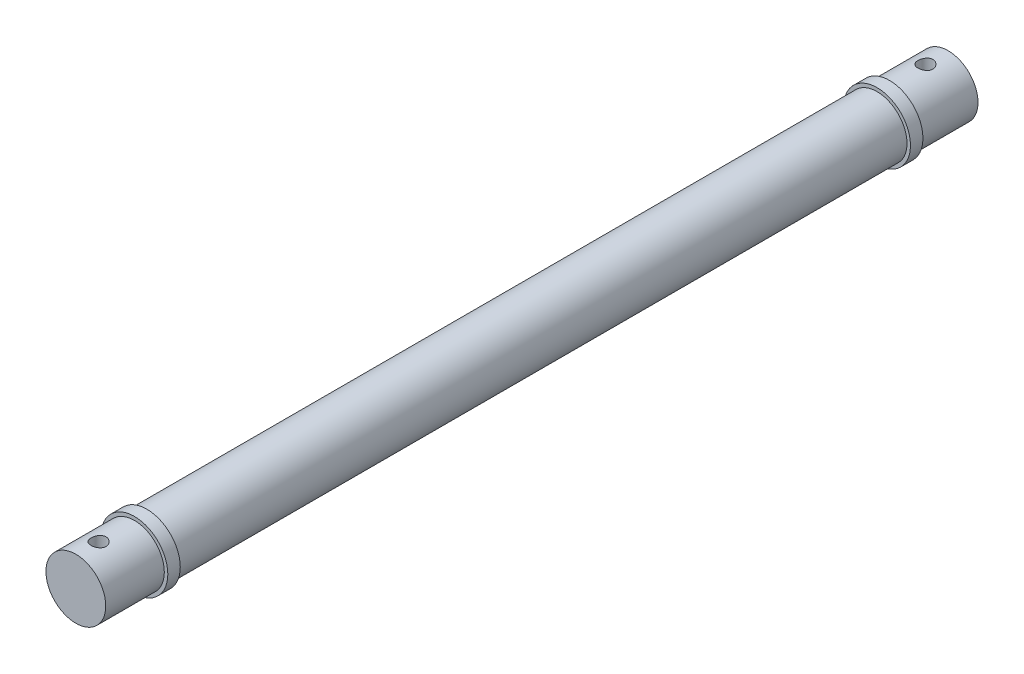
from build123d import *

# Parameters (mm, degrees)
SKETCH1_R           = 2.4
BOSS_EXTRUDE1_DEPTH = 70
SKETCH2_R           = 2.68
SKETCH2_R_2         = 2.4
BOSS_EXTRUDE3_DEPTH = 1
SKETCH3_R           = 2.68
SKETCH3_R_2         = 2.4
BOSS_EXTRUDE4_DEPTH = 1
SKETCH4_R           = 0.6
CUT_EXTRUDE1_DEPTH  = 5


with BuildPart() as part:
    # Sketch1 → Boss-Extrude1 (new body)
    with BuildSketch(Plane.XY):
        Circle(SKETCH1_R)
    extrude(amount=BOSS_EXTRUDE1_DEPTH)

    # Sketch4 → Cut-Extrude1 (cut, symmetric)
    with BuildSketch(Plane(origin=(0, 0, 0), x_dir=(1, 0, 0), z_dir=(0, 1, 0))):
        with Locations(Location((0, -1.821506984, 0), (0, 0, 270))):
            Circle(SKETCH4_R)
    cut_extrude1 = extrude(amount=CUT_EXTRUDE1_DEPTH, both=True, mode=Mode.SUBTRACT)

    # Mirror1: Cut-Extrude1 across plane
    add(cut_extrude1.mirror(Plane.XY.offset(35)), mode=Mode.SUBTRACT)


with BuildPart() as body_2:
    # Sketch2 → Boss-Extrude3 (new body)
    with BuildSketch(Plane(origin=(0, 0, 5.7), x_dir=(-1, 0, 0), z_dir=(0, 0, -1))):
        Circle(SKETCH2_R)
        Circle(SKETCH2_R_2, mode=Mode.SUBTRACT)
    extrude(amount=BOSS_EXTRUDE3_DEPTH)


with BuildPart() as body_3:
    # Sketch3 → Boss-Extrude4 (new body)
    with BuildSketch(Plane.XY.offset(64.3)):
        Circle(SKETCH3_R)
        Circle(SKETCH3_R_2, mode=Mode.SUBTRACT)
    extrude(amount=BOSS_EXTRUDE4_DEPTH)


solid = Compound([part.part, body_2.part, body_3.part])
